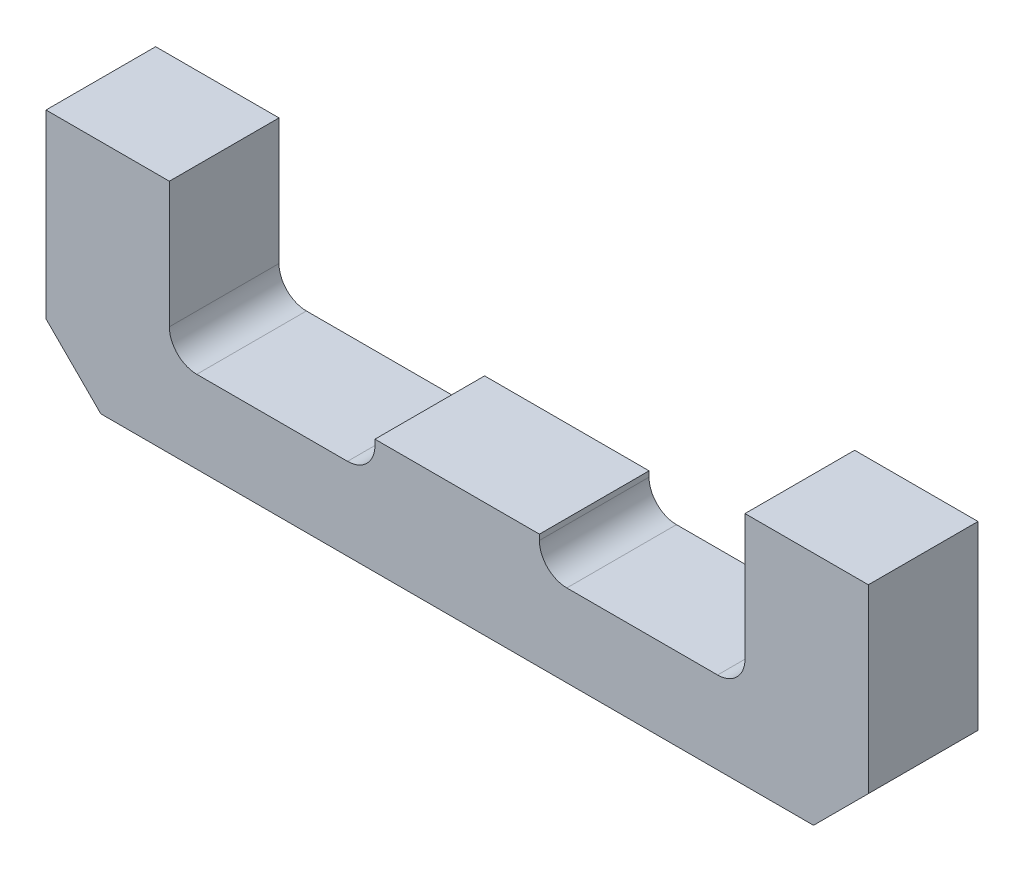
from build123d import *

# Parameters (mm, degrees)
EXTRUSION1_DEPTH = 20
CHANFREIN1_SIZE  = 10
CONG_1_R         = 5


with BuildPart() as part:
    # Esquisse1 → Extrusion1 (new body)
    with BuildSketch(Plane.XY):
        Polygon((-15, 0), (15, 0), (15, -6), (52.5, -6), (52.5, 22), (75, 22), (75, -21), (-75, -21), (-75, 22), (-52.5, 22), (-52.5, -6), (-15, -6), align=None)
    extrude(amount=EXTRUSION1_DEPTH)

    # Chanfrein1
    chanfrein1_edges = [part.edges().sort_by_distance(p)[0] for p in [
        (75, -21, 10),
        (-75, -21, 10),
    ]]
    chamfer(chanfrein1_edges, length=CHANFREIN1_SIZE)

    # Cong_1
    cong_1_edges = [part.edges().sort_by_distance(p)[0] for p in [
        (15, -6, 10),
        (52.5, -6, 10),
        (-52.5, -6, 10),
        (-15, -6, 10),
    ]]
    fillet(cong_1_edges, radius=CONG_1_R)


solid = part.part
